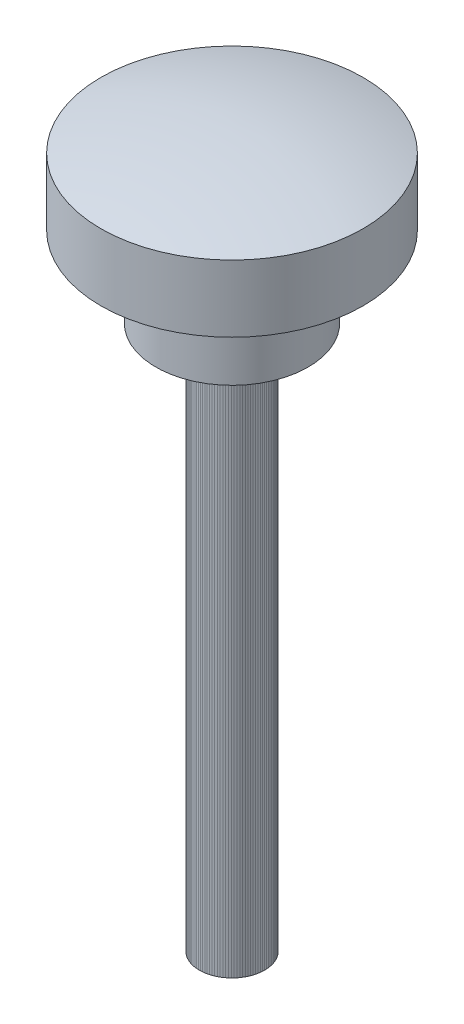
ISO-10303-21;
HEADER;
FILE_DESCRIPTION(('STEP AP214'),'2;1');
FILE_NAME('part.step','',(''),(''),'','','');
FILE_SCHEMA(('AUTOMOTIVE_DESIGN { 1 0 10303 214 1 1 1 1 }'));
ENDSEC;
DATA;
#1=APPLICATION_CONTEXT('core data for automotive mechanical design processes');
#2=APPLICATION_PROTOCOL_DEFINITION('international standard','automotive_design',2000,#1);
#3=PRODUCT_CONTEXT('',#1,'mechanical');
#4=PRODUCT('Part','Part','',(#3));
#5=PRODUCT_RELATED_PRODUCT_CATEGORY('part','',(#4));
#6=PRODUCT_DEFINITION_FORMATION('','',#4);
#7=PRODUCT_DEFINITION_CONTEXT('part definition',#1,'design');
#8=PRODUCT_DEFINITION('design','',#6,#7);
#9=PRODUCT_DEFINITION_SHAPE('','',#8);
#10=(LENGTH_UNIT() NAMED_UNIT(*) SI_UNIT(.MILLI.,.METRE.));
#11=(NAMED_UNIT(*) PLANE_ANGLE_UNIT() SI_UNIT($,.RADIAN.));
#12=(NAMED_UNIT(*) SI_UNIT($,.STERADIAN.) SOLID_ANGLE_UNIT());
#13=UNCERTAINTY_MEASURE_WITH_UNIT(LENGTH_MEASURE(1.E-05),#10,'distance_accuracy_value','');
#14=(GEOMETRIC_REPRESENTATION_CONTEXT(3) GLOBAL_UNCERTAINTY_ASSIGNED_CONTEXT((#13)) GLOBAL_UNIT_ASSIGNED_CONTEXT((#10,
#11,#12)) REPRESENTATION_CONTEXT('',''));
#15=CARTESIAN_POINT('',(0.,0.,0.));
#16=DIRECTION('',(0.,0.,1.));
#17=DIRECTION('',(1.,0.,0.));
#18=AXIS2_PLACEMENT_3D('',#15,#16,#17);
#19=CARTESIAN_POINT('',(0.,-25.,0.));
#20=DIRECTION('',(0.,1.,0.));
#21=DIRECTION('',(0.,0.,1.));
#22=AXIS2_PLACEMENT_3D('',#19,#20,#21);
#23=CYLINDRICAL_SURFACE('',#22,1.5);
#24=CARTESIAN_POINT('',(0.,0.,0.));
#25=DIRECTION('',(0.,1.,0.));
#26=DIRECTION('',(0.,0.,1.));
#27=AXIS2_PLACEMENT_3D('',#24,#25,#26);
#28=CIRCLE('',#27,1.5);
#29=CARTESIAN_POINT('',(0.,0.,1.5));
#30=VERTEX_POINT('',#29);
#31=EDGE_CURVE('P0_E16',#30,#30,#28,.F.);
#32=ORIENTED_EDGE('',*,*,#31,.T.);
#33=EDGE_LOOP('',(#32));
#34=FACE_BOUND('',#33,.T.);
#35=CARTESIAN_POINT('',(0.,-25.,0.));
#36=DIRECTION('',(0.,1.,0.));
#37=DIRECTION('',(0.,0.,1.));
#38=AXIS2_PLACEMENT_3D('',#35,#36,#37);
#39=CIRCLE('',#38,1.5);
#40=CARTESIAN_POINT('',(0.,-25.,1.5));
#41=VERTEX_POINT('',#40);
#42=EDGE_CURVE('P0_E10',#41,#41,#39,.T.);
#43=ORIENTED_EDGE('',*,*,#42,.T.);
#44=EDGE_LOOP('',(#43));
#45=FACE_BOUND('',#44,.T.);
#46=ADVANCED_FACE('P0_F15',(#34,#45),#23,.T.);
#47=OPEN_SHELL('',(#46));
#48=SHELL_BASED_SURFACE_MODEL('P0_B1',(#47));
#49=CARTESIAN_POINT('',(0.,-12.3,0.));
#50=DIRECTION('',(-1.,0.,0.));
#51=DIRECTION('',(0.,0.,-1.));
#52=AXIS2_PLACEMENT_3D('',#49,#50,#51);
#53=SPHERICAL_SURFACE('',#52,20.);
#54=CARTESIAN_POINT('',(0.,6.770903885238,0.));
#55=DIRECTION('',(0.,-1.,0.));
#56=DIRECTION('',(0.,0.,-1.));
#57=AXIS2_PLACEMENT_3D('',#54,#55,#56);
#58=CIRCLE('',#57,6.025);
#59=CARTESIAN_POINT('',(0.,6.770903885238,-6.025));
#60=VERTEX_POINT('',#59);
#61=EDGE_CURVE('P1_E19',#60,#60,#58,.T.);
#62=ORIENTED_EDGE('',*,*,#61,.F.);
#63=EDGE_LOOP('',(#62));
#64=FACE_BOUND('',#63,.T.);
#65=ADVANCED_FACE('P1_F15',(#64),#53,.T.);
#66=CARTESIAN_POINT('',(0.,8.085,0.));
#67=DIRECTION('',(0.,-1.,0.));
#68=DIRECTION('',(0.,0.,-1.));
#69=AXIS2_PLACEMENT_3D('',#66,#67,#68);
#70=CYLINDRICAL_SURFACE('',#69,6.025);
#71=ORIENTED_EDGE('',*,*,#61,.T.);
#72=EDGE_LOOP('',(#71));
#73=FACE_BOUND('',#72,.T.);
#74=CARTESIAN_POINT('',(0.,3.7,0.));
#75=DIRECTION('',(0.,-1.,0.));
#76=DIRECTION('',(0.,0.,-1.));
#77=AXIS2_PLACEMENT_3D('',#74,#75,#76);
#78=CIRCLE('',#77,6.025);
#79=CARTESIAN_POINT('',(0.,3.7,-6.025));
#80=VERTEX_POINT('',#79);
#81=EDGE_CURVE('P1_E36',#80,#80,#78,.T.);
#82=ORIENTED_EDGE('',*,*,#81,.F.);
#83=EDGE_LOOP('',(#82));
#84=FACE_BOUND('',#83,.T.);
#85=ADVANCED_FACE('P1_F43',(#73,#84),#70,.T.);
#86=CARTESIAN_POINT('',(0.,3.7,0.));
#87=DIRECTION('',(0.,-1.,0.));
#88=DIRECTION('',(0.,0.,-1.));
#89=AXIS2_PLACEMENT_3D('',#86,#87,#88);
#90=PLANE('',#89);
#91=CARTESIAN_POINT('',(0.,3.7,0.));
#92=DIRECTION('',(0.,-1.,0.));
#93=DIRECTION('',(0.,0.,-1.));
#94=AXIS2_PLACEMENT_3D('',#91,#92,#93);
#95=CIRCLE('',#94,3.5);
#96=CARTESIAN_POINT('',(0.,3.7,-3.5));
#97=VERTEX_POINT('',#96);
#98=EDGE_CURVE('P1_E34',#97,#97,#95,.T.);
#99=ORIENTED_EDGE('',*,*,#98,.F.);
#100=EDGE_LOOP('',(#99));
#101=FACE_BOUND('',#100,.T.);
#102=ORIENTED_EDGE('',*,*,#81,.T.);
#103=EDGE_LOOP('',(#102));
#104=FACE_BOUND('',#103,.T.);
#105=ADVANCED_FACE('P1_F51',(#101,#104),#90,.T.);
#106=CARTESIAN_POINT('',(0.,8.085,0.));
#107=DIRECTION('',(0.,-1.,0.));
#108=DIRECTION('',(0.,0.,-1.));
#109=AXIS2_PLACEMENT_3D('',#106,#107,#108);
#110=CYLINDRICAL_SURFACE('',#109,3.5);
#111=ORIENTED_EDGE('',*,*,#98,.T.);
#112=EDGE_LOOP('',(#111));
#113=FACE_BOUND('',#112,.T.);
#114=CARTESIAN_POINT('',(0.,0.,0.));
#115=DIRECTION('',(0.,-1.,0.));
#116=DIRECTION('',(0.,0.,-1.));
#117=AXIS2_PLACEMENT_3D('',#114,#115,#116);
#118=CIRCLE('',#117,3.5);
#119=CARTESIAN_POINT('',(0.,0.,-3.5));
#120=VERTEX_POINT('',#119);
#121=EDGE_CURVE('P1_E28',#120,#120,#118,.T.);
#122=ORIENTED_EDGE('',*,*,#121,.F.);
#123=EDGE_LOOP('',(#122));
#124=FACE_BOUND('',#123,.T.);
#125=ADVANCED_FACE('P1_F66',(#113,#124),#110,.T.);
#126=CARTESIAN_POINT('',(0.,-25.,0.));
#127=DIRECTION('',(0.,-1.,0.));
#128=DIRECTION('',(0.,0.,-1.));
#129=AXIS2_PLACEMENT_3D('',#126,#127,#128);
#130=PLANE('',#129);
#131=CARTESIAN_POINT('',(0.,-25.,0.));
#132=DIRECTION('',(0.,-1.,0.));
#133=DIRECTION('',(0.,0.,-1.));
#134=AXIS2_PLACEMENT_3D('',#131,#132,#133);
#135=CIRCLE('',#134,1.5);
#136=CARTESIAN_POINT('',(0.,-25.,-1.5));
#137=VERTEX_POINT('',#136);
#138=EDGE_CURVE('P1_E23',#137,#137,#135,.F.);
#139=ORIENTED_EDGE('',*,*,#138,.F.);
#140=EDGE_LOOP('',(#139));
#141=FACE_BOUND('',#140,.T.);
#142=ADVANCED_FACE('P1_F60',(#141),#130,.T.);
#143=CARTESIAN_POINT('',(0.,0.,0.));
#144=DIRECTION('',(0.,-1.,0.));
#145=DIRECTION('',(0.,0.,-1.));
#146=AXIS2_PLACEMENT_3D('',#143,#144,#145);
#147=PLANE('',#146);
#148=CARTESIAN_POINT('',(0.,0.,0.));
#149=DIRECTION('',(0.,-1.,0.));
#150=DIRECTION('',(0.,0.,-1.));
#151=AXIS2_PLACEMENT_3D('',#148,#149,#150);
#152=CIRCLE('',#151,1.5);
#153=CARTESIAN_POINT('',(0.,0.,-1.5));
#154=VERTEX_POINT('',#153);
#155=EDGE_CURVE('P1_E10',#154,#154,#152,.T.);
#156=ORIENTED_EDGE('',*,*,#155,.F.);
#157=EDGE_LOOP('',(#156));
#158=FACE_BOUND('',#157,.T.);
#159=ORIENTED_EDGE('',*,*,#121,.T.);
#160=EDGE_LOOP('',(#159));
#161=FACE_BOUND('',#160,.T.);
#162=ADVANCED_FACE('P1_F54',(#158,#161),#147,.T.);
#163=CARTESIAN_POINT('',(0.,0.,0.));
#164=DIRECTION('',(0.,-1.,0.));
#165=DIRECTION('',(0.,0.,-1.));
#166=AXIS2_PLACEMENT_3D('',#163,#164,#165);
#167=CYLINDRICAL_SURFACE('',#166,1.5);
#168=ORIENTED_EDGE('',*,*,#138,.T.);
#169=EDGE_LOOP('',(#168));
#170=FACE_BOUND('',#169,.T.);
#171=ORIENTED_EDGE('',*,*,#155,.T.);
#172=EDGE_LOOP('',(#171));
#173=FACE_BOUND('',#172,.T.);
#174=ADVANCED_FACE('P1_F52',(#170,#173),#167,.T.);
#175=CLOSED_SHELL('',(#65,#85,#105,#125,#142,#162,#174));
#176=MANIFOLD_SOLID_BREP('P1_B1',#175);
#177=ADVANCED_BREP_SHAPE_REPRESENTATION('',(#18,#176),#14);
#178=MANIFOLD_SURFACE_SHAPE_REPRESENTATION('',(#18,#48),#14);
#179=SHAPE_REPRESENTATION('',(#18),#14);
#180=SHAPE_DEFINITION_REPRESENTATION(#9,#179);
#181=SHAPE_REPRESENTATION_RELATIONSHIP('','',#179,#177);
#182=SHAPE_REPRESENTATION_RELATIONSHIP('','',#179,#178);
ENDSEC;
END-ISO-10303-21;
